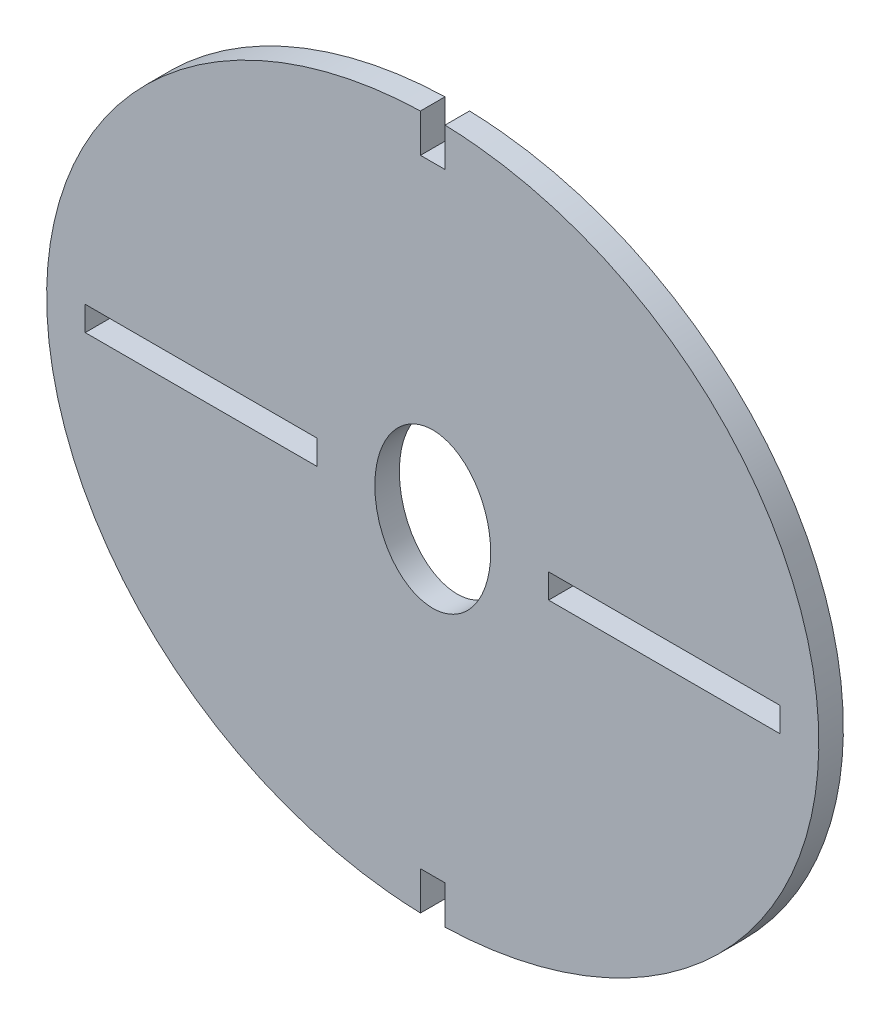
ISO-10303-21;
HEADER;
FILE_DESCRIPTION(('STEP AP214'),'2;1');
FILE_NAME('part.step','',(''),(''),'','','');
FILE_SCHEMA(('AUTOMOTIVE_DESIGN { 1 0 10303 214 1 1 1 1 }'));
ENDSEC;
DATA;
#1=APPLICATION_CONTEXT('core data for automotive mechanical design processes');
#2=APPLICATION_PROTOCOL_DEFINITION('international standard','automotive_design',2000,#1);
#3=PRODUCT_CONTEXT('',#1,'mechanical');
#4=PRODUCT('Part','Part','',(#3));
#5=PRODUCT_RELATED_PRODUCT_CATEGORY('part','',(#4));
#6=PRODUCT_DEFINITION_FORMATION('','',#4);
#7=PRODUCT_DEFINITION_CONTEXT('part definition',#1,'design');
#8=PRODUCT_DEFINITION('design','',#6,#7);
#9=PRODUCT_DEFINITION_SHAPE('','',#8);
#10=(LENGTH_UNIT() NAMED_UNIT(*) SI_UNIT(.MILLI.,.METRE.));
#11=(NAMED_UNIT(*) PLANE_ANGLE_UNIT() SI_UNIT($,.RADIAN.));
#12=(NAMED_UNIT(*) SI_UNIT($,.STERADIAN.) SOLID_ANGLE_UNIT());
#13=UNCERTAINTY_MEASURE_WITH_UNIT(LENGTH_MEASURE(1.E-05),#10,'distance_accuracy_value','');
#14=(GEOMETRIC_REPRESENTATION_CONTEXT(3) GLOBAL_UNCERTAINTY_ASSIGNED_CONTEXT((#13)) GLOBAL_UNIT_ASSIGNED_CONTEXT((#10,
#11,#12)) REPRESENTATION_CONTEXT('',''));
#15=CARTESIAN_POINT('',(0.,0.,0.));
#16=DIRECTION('',(0.,0.,1.));
#17=DIRECTION('',(1.,0.,0.));
#18=AXIS2_PLACEMENT_3D('',#15,#16,#17);
#19=CARTESIAN_POINT('',(0.,0.,3.175));
#20=DIRECTION('',(0.,0.,1.));
#21=DIRECTION('',(-1.,0.,0.));
#22=AXIS2_PLACEMENT_3D('',#19,#20,#21);
#23=ELLIPSE('',#22,50.,45.);
#24=DIRECTION('',(0.,0.,-1.));
#25=VECTOR('',#24,1.);
#26=SURFACE_OF_LINEAR_EXTRUSION('',#23,#25);
#27=CARTESIAN_POINT('',(0.,0.,0.));
#28=DIRECTION('',(0.,0.,1.));
#29=DIRECTION('',(-1.,0.,0.));
#30=AXIS2_PLACEMENT_3D('',#27,#28,#29);
#31=ELLIPSE('',#30,50.,45.);
#32=CARTESIAN_POINT('',(-1.58750000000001,44.9773128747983,0.));
#33=VERTEX_POINT('',#32);
#34=CARTESIAN_POINT('',(-1.58749999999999,-44.9773128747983,0.));
#35=VERTEX_POINT('',#34);
#36=EDGE_CURVE('E285',#33,#35,#31,.T.);
#37=ORIENTED_EDGE('',*,*,#36,.T.);
#38=DIRECTION('',(0.,0.,-1.));
#39=VECTOR('',#38,1.);
#40=CARTESIAN_POINT('',(-1.58749999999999,-44.9773128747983,3.175));
#41=LINE('',#40,#39);
#42=CARTESIAN_POINT('',(-1.58749999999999,-44.9773128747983,3.175));
#43=VERTEX_POINT('',#42);
#44=EDGE_CURVE('E41',#35,#43,#41,.F.);
#45=ORIENTED_EDGE('',*,*,#44,.T.);
#46=CARTESIAN_POINT('',(-1.5875,44.9773128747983,3.175));
#47=VERTEX_POINT('',#46);
#48=EDGE_CURVE('E289',#47,#43,#23,.T.);
#49=ORIENTED_EDGE('',*,*,#48,.F.);
#50=DIRECTION('',(0.,0.,-1.));
#51=VECTOR('',#50,1.);
#52=CARTESIAN_POINT('',(-1.5875,44.9773128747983,3.175));
#53=LINE('',#52,#51);
#54=EDGE_CURVE('E287',#47,#33,#53,.T.);
#55=ORIENTED_EDGE('',*,*,#54,.T.);
#56=EDGE_LOOP('',(#37,#45,#49,#55));
#57=FACE_BOUND('',#56,.T.);
#58=ADVANCED_FACE('F32',(#57),#26,.F.);
#59=CARTESIAN_POINT('',(0.,0.,3.175));
#60=DIRECTION('',(0.,0.,1.));
#61=DIRECTION('',(1.,0.,0.));
#62=AXIS2_PLACEMENT_3D('',#59,#60,#61);
#63=PLANE('',#62);
#64=DIRECTION('',(0.,-1.,0.));
#65=VECTOR('',#64,1.);
#66=CARTESIAN_POINT('',(-1.58749999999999,-40.,3.175));
#67=LINE('',#66,#65);
#68=CARTESIAN_POINT('',(-1.58749999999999,-40.,3.175));
#69=VERTEX_POINT('',#68);
#70=EDGE_CURVE('E160',#69,#43,#67,.T.);
#71=ORIENTED_EDGE('',*,*,#70,.F.);
#72=DIRECTION('',(-1.,0.,0.));
#73=VECTOR('',#72,1.);
#74=CARTESIAN_POINT('',(0.,-40.,3.175));
#75=LINE('',#74,#73);
#76=CARTESIAN_POINT('',(1.58750000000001,-40.,3.175));
#77=VERTEX_POINT('',#76);
#78=EDGE_CURVE('E153',#77,#69,#75,.T.);
#79=ORIENTED_EDGE('',*,*,#78,.F.);
#80=DIRECTION('',(0.,1.,0.));
#81=VECTOR('',#80,1.);
#82=CARTESIAN_POINT('',(1.58750000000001,-56.8634224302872,3.175));
#83=LINE('',#82,#81);
#84=CARTESIAN_POINT('',(1.58750000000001,-44.9773128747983,3.175));
#85=VERTEX_POINT('',#84);
#86=EDGE_CURVE('E157',#85,#77,#83,.T.);
#87=ORIENTED_EDGE('',*,*,#86,.F.);
#88=CARTESIAN_POINT('',(1.58750000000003,44.9773128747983,3.175));
#89=VERTEX_POINT('',#88);
#90=EDGE_CURVE('E56',#85,#89,#23,.T.);
#91=ORIENTED_EDGE('',*,*,#90,.T.);
#92=DIRECTION('',(0.,1.,0.));
#93=VECTOR('',#92,1.);
#94=CARTESIAN_POINT('',(1.5875,56.8634224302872,3.175));
#95=LINE('',#94,#93);
#96=CARTESIAN_POINT('',(1.5875,40.,3.175));
#97=VERTEX_POINT('',#96);
#98=EDGE_CURVE('E173',#97,#89,#95,.T.);
#99=ORIENTED_EDGE('',*,*,#98,.F.);
#100=DIRECTION('',(1.,0.,0.));
#101=VECTOR('',#100,1.);
#102=CARTESIAN_POINT('',(0.,40.,3.175));
#103=LINE('',#102,#101);
#104=CARTESIAN_POINT('',(-1.5875,40.,3.175));
#105=VERTEX_POINT('',#104);
#106=EDGE_CURVE('E178',#105,#97,#103,.T.);
#107=ORIENTED_EDGE('',*,*,#106,.F.);
#108=DIRECTION('',(0.,-1.,0.));
#109=VECTOR('',#108,1.);
#110=CARTESIAN_POINT('',(-1.5875,40.,3.175));
#111=LINE('',#110,#109);
#112=EDGE_CURVE('E175',#47,#105,#111,.T.);
#113=ORIENTED_EDGE('',*,*,#112,.F.);
#114=ORIENTED_EDGE('',*,*,#48,.T.);
#115=EDGE_LOOP('',(#71,#79,#87,#91,#99,#107,#113,#114));
#116=FACE_BOUND('',#115,.T.);
#117=CARTESIAN_POINT('',(0.,0.,3.175));
#118=DIRECTION('',(0.,0.,1.));
#119=DIRECTION('',(0.,-1.,0.));
#120=AXIS2_PLACEMENT_3D('',#117,#118,#119);
#121=ELLIPSE('',#120,10.,7.5);
#122=CARTESIAN_POINT('',(0.,-10.,3.175));
#123=VERTEX_POINT('',#122);
#124=EDGE_CURVE('E254',#123,#123,#121,.T.);
#125=ORIENTED_EDGE('',*,*,#124,.F.);
#126=EDGE_LOOP('',(#125));
#127=FACE_BOUND('',#126,.T.);
#128=DIRECTION('',(1.,0.,0.));
#129=VECTOR('',#128,1.);
#130=CARTESIAN_POINT('',(-45.,-1.58750000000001,3.175));
#131=LINE('',#130,#129);
#132=CARTESIAN_POINT('',(-45.,-1.58750000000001,3.175));
#133=VERTEX_POINT('',#132);
#134=CARTESIAN_POINT('',(-15.,-1.58750000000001,3.175));
#135=VERTEX_POINT('',#134);
#136=EDGE_CURVE('E225',#133,#135,#131,.T.);
#137=ORIENTED_EDGE('',*,*,#136,.F.);
#138=DIRECTION('',(0.,-1.,0.));
#139=VECTOR('',#138,1.);
#140=CARTESIAN_POINT('',(-45.,1.58749999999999,3.175));
#141=LINE('',#140,#139);
#142=CARTESIAN_POINT('',(-45.,1.58749999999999,3.175));
#143=VERTEX_POINT('',#142);
#144=EDGE_CURVE('E223',#143,#133,#141,.T.);
#145=ORIENTED_EDGE('',*,*,#144,.F.);
#146=DIRECTION('',(-1.,0.,0.));
#147=VECTOR('',#146,1.);
#148=CARTESIAN_POINT('',(-15.,1.5875,3.175));
#149=LINE('',#148,#147);
#150=CARTESIAN_POINT('',(-15.,1.5875,3.175));
#151=VERTEX_POINT('',#150);
#152=EDGE_CURVE('E231',#151,#143,#149,.T.);
#153=ORIENTED_EDGE('',*,*,#152,.F.);
#154=DIRECTION('',(0.,1.,0.));
#155=VECTOR('',#154,1.);
#156=CARTESIAN_POINT('',(-15.,1.5875,3.175));
#157=LINE('',#156,#155);
#158=EDGE_CURVE('E228',#135,#151,#157,.T.);
#159=ORIENTED_EDGE('',*,*,#158,.F.);
#160=EDGE_LOOP('',(#137,#145,#153,#159));
#161=FACE_BOUND('',#160,.T.);
#162=DIRECTION('',(0.,-1.,0.));
#163=VECTOR('',#162,1.);
#164=CARTESIAN_POINT('',(15.,1.5875,3.175));
#165=LINE('',#164,#163);
#166=CARTESIAN_POINT('',(15.,1.5875,3.175));
#167=VERTEX_POINT('',#166);
#168=CARTESIAN_POINT('',(15.,-1.5875,3.175));
#169=VERTEX_POINT('',#168);
#170=EDGE_CURVE('E194',#167,#169,#165,.T.);
#171=ORIENTED_EDGE('',*,*,#170,.F.);
#172=DIRECTION('',(-1.,0.,0.));
#173=VECTOR('',#172,1.);
#174=CARTESIAN_POINT('',(15.,1.5875,3.175));
#175=LINE('',#174,#173);
#176=CARTESIAN_POINT('',(45.,1.58750000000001,3.175));
#177=VERTEX_POINT('',#176);
#178=EDGE_CURVE('E192',#177,#167,#175,.T.);
#179=ORIENTED_EDGE('',*,*,#178,.F.);
#180=DIRECTION('',(0.,1.,0.));
#181=VECTOR('',#180,1.);
#182=CARTESIAN_POINT('',(45.,1.58750000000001,3.175));
#183=LINE('',#182,#181);
#184=CARTESIAN_POINT('',(45.,-1.58749999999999,3.175));
#185=VERTEX_POINT('',#184);
#186=EDGE_CURVE('E200',#185,#177,#183,.T.);
#187=ORIENTED_EDGE('',*,*,#186,.F.);
#188=DIRECTION('',(1.,0.,0.));
#189=VECTOR('',#188,1.);
#190=CARTESIAN_POINT('',(45.,-1.58749999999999,3.175));
#191=LINE('',#190,#189);
#192=EDGE_CURVE('E197',#169,#185,#191,.T.);
#193=ORIENTED_EDGE('',*,*,#192,.F.);
#194=EDGE_LOOP('',(#171,#179,#187,#193));
#195=FACE_BOUND('',#194,.T.);
#196=ADVANCED_FACE('F162',(#116,#127,#161,#195),#63,.T.);
#197=CARTESIAN_POINT('',(0.,0.,0.));
#198=DIRECTION('',(0.,0.,1.));
#199=DIRECTION('',(1.,0.,0.));
#200=AXIS2_PLACEMENT_3D('',#197,#198,#199);
#201=PLANE('',#200);
#202=DIRECTION('',(0.,-1.,0.));
#203=VECTOR('',#202,1.);
#204=CARTESIAN_POINT('',(-45.,1.58749999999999,0.));
#205=LINE('',#204,#203);
#206=CARTESIAN_POINT('',(-45.,1.58749999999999,0.));
#207=VERTEX_POINT('',#206);
#208=CARTESIAN_POINT('',(-45.,-1.58750000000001,0.));
#209=VERTEX_POINT('',#208);
#210=EDGE_CURVE('E222',#207,#209,#205,.T.);
#211=ORIENTED_EDGE('',*,*,#210,.T.);
#212=DIRECTION('',(1.,0.,0.));
#213=VECTOR('',#212,1.);
#214=CARTESIAN_POINT('',(-45.,-1.58750000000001,0.));
#215=LINE('',#214,#213);
#216=CARTESIAN_POINT('',(-15.,-1.58750000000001,0.));
#217=VERTEX_POINT('',#216);
#218=EDGE_CURVE('E236',#209,#217,#215,.T.);
#219=ORIENTED_EDGE('',*,*,#218,.T.);
#220=DIRECTION('',(0.,1.,0.));
#221=VECTOR('',#220,1.);
#222=CARTESIAN_POINT('',(-15.,1.5875,0.));
#223=LINE('',#222,#221);
#224=CARTESIAN_POINT('',(-15.,1.5875,0.));
#225=VERTEX_POINT('',#224);
#226=EDGE_CURVE('E239',#217,#225,#223,.T.);
#227=ORIENTED_EDGE('',*,*,#226,.T.);
#228=DIRECTION('',(-1.,0.,0.));
#229=VECTOR('',#228,1.);
#230=CARTESIAN_POINT('',(-15.,1.5875,0.));
#231=LINE('',#230,#229);
#232=EDGE_CURVE('E226',#225,#207,#231,.T.);
#233=ORIENTED_EDGE('',*,*,#232,.T.);
#234=EDGE_LOOP('',(#211,#219,#227,#233));
#235=FACE_BOUND('',#234,.T.);
#236=DIRECTION('',(-1.,0.,0.));
#237=VECTOR('',#236,1.);
#238=CARTESIAN_POINT('',(0.,-40.,0.));
#239=LINE('',#238,#237);
#240=CARTESIAN_POINT('',(1.58750000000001,-40.,0.));
#241=VERTEX_POINT('',#240);
#242=CARTESIAN_POINT('',(-1.58749999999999,-40.,0.));
#243=VERTEX_POINT('',#242);
#244=EDGE_CURVE('E11',#241,#243,#239,.T.);
#245=ORIENTED_EDGE('',*,*,#244,.T.);
#246=DIRECTION('',(0.,-1.,0.));
#247=VECTOR('',#246,1.);
#248=CARTESIAN_POINT('',(-1.5875,0.,0.));
#249=LINE('',#248,#247);
#250=EDGE_CURVE('E170',#243,#35,#249,.T.);
#251=ORIENTED_EDGE('',*,*,#250,.T.);
#252=ORIENTED_EDGE('',*,*,#36,.F.);
#253=DIRECTION('',(0.,-1.,0.));
#254=VECTOR('',#253,1.);
#255=CARTESIAN_POINT('',(-1.5875,0.,0.));
#256=LINE('',#255,#254);
#257=CARTESIAN_POINT('',(-1.5875,40.,0.));
#258=VERTEX_POINT('',#257);
#259=EDGE_CURVE('E188',#33,#258,#256,.T.);
#260=ORIENTED_EDGE('',*,*,#259,.T.);
#261=DIRECTION('',(1.,0.,0.));
#262=VECTOR('',#261,1.);
#263=CARTESIAN_POINT('',(0.,40.,0.));
#264=LINE('',#263,#262);
#265=CARTESIAN_POINT('',(1.5875,40.,0.));
#266=VERTEX_POINT('',#265);
#267=EDGE_CURVE('E296',#258,#266,#264,.T.);
#268=ORIENTED_EDGE('',*,*,#267,.T.);
#269=DIRECTION('',(0.,1.,0.));
#270=VECTOR('',#269,1.);
#271=CARTESIAN_POINT('',(1.58750000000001,0.,0.));
#272=LINE('',#271,#270);
#273=CARTESIAN_POINT('',(1.58750000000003,44.9773128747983,0.));
#274=VERTEX_POINT('',#273);
#275=EDGE_CURVE('E184',#266,#274,#272,.T.);
#276=ORIENTED_EDGE('',*,*,#275,.T.);
#277=CARTESIAN_POINT('',(1.58750000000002,-44.9773128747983,0.));
#278=VERTEX_POINT('',#277);
#279=EDGE_CURVE('E258',#278,#274,#31,.T.);
#280=ORIENTED_EDGE('',*,*,#279,.F.);
#281=DIRECTION('',(0.,1.,0.));
#282=VECTOR('',#281,1.);
#283=CARTESIAN_POINT('',(1.58750000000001,0.,0.));
#284=LINE('',#283,#282);
#285=EDGE_CURVE('E48',#278,#241,#284,.T.);
#286=ORIENTED_EDGE('',*,*,#285,.T.);
#287=EDGE_LOOP('',(#245,#251,#252,#260,#268,#276,#280,#286));
#288=FACE_BOUND('',#287,.T.);
#289=CARTESIAN_POINT('',(0.,0.,0.));
#290=DIRECTION('',(0.,0.,1.));
#291=DIRECTION('',(0.,-1.,0.));
#292=AXIS2_PLACEMENT_3D('',#289,#290,#291);
#293=ELLIPSE('',#292,10.,7.5);
#294=CARTESIAN_POINT('',(0.,-10.,0.));
#295=VERTEX_POINT('',#294);
#296=EDGE_CURVE('E253',#295,#295,#293,.T.);
#297=ORIENTED_EDGE('',*,*,#296,.T.);
#298=EDGE_LOOP('',(#297));
#299=FACE_BOUND('',#298,.T.);
#300=DIRECTION('',(-1.,0.,0.));
#301=VECTOR('',#300,1.);
#302=CARTESIAN_POINT('',(15.,1.5875,0.));
#303=LINE('',#302,#301);
#304=CARTESIAN_POINT('',(45.,1.58750000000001,0.));
#305=VERTEX_POINT('',#304);
#306=CARTESIAN_POINT('',(15.,1.5875,0.));
#307=VERTEX_POINT('',#306);
#308=EDGE_CURVE('E191',#305,#307,#303,.T.);
#309=ORIENTED_EDGE('',*,*,#308,.T.);
#310=DIRECTION('',(0.,-1.,0.));
#311=VECTOR('',#310,1.);
#312=CARTESIAN_POINT('',(15.,1.5875,0.));
#313=LINE('',#312,#311);
#314=CARTESIAN_POINT('',(15.,-1.5875,0.));
#315=VERTEX_POINT('',#314);
#316=EDGE_CURVE('E205',#307,#315,#313,.T.);
#317=ORIENTED_EDGE('',*,*,#316,.T.);
#318=DIRECTION('',(1.,0.,0.));
#319=VECTOR('',#318,1.);
#320=CARTESIAN_POINT('',(45.,-1.58749999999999,0.));
#321=LINE('',#320,#319);
#322=CARTESIAN_POINT('',(45.,-1.58749999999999,0.));
#323=VERTEX_POINT('',#322);
#324=EDGE_CURVE('E208',#315,#323,#321,.T.);
#325=ORIENTED_EDGE('',*,*,#324,.T.);
#326=DIRECTION('',(0.,1.,0.));
#327=VECTOR('',#326,1.);
#328=CARTESIAN_POINT('',(45.,1.58750000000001,0.));
#329=LINE('',#328,#327);
#330=EDGE_CURVE('E195',#323,#305,#329,.T.);
#331=ORIENTED_EDGE('',*,*,#330,.T.);
#332=EDGE_LOOP('',(#309,#317,#325,#331));
#333=FACE_BOUND('',#332,.T.);
#334=ADVANCED_FACE('F268',(#235,#288,#299,#333),#201,.F.);
#335=ORIENTED_EDGE('',*,*,#90,.F.);
#336=DIRECTION('',(0.,0.,-1.));
#337=VECTOR('',#336,1.);
#338=CARTESIAN_POINT('',(1.58750000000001,-44.9773128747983,3.175));
#339=LINE('',#338,#337);
#340=EDGE_CURVE('E159',#85,#278,#339,.T.);
#341=ORIENTED_EDGE('',*,*,#340,.T.);
#342=ORIENTED_EDGE('',*,*,#279,.T.);
#343=DIRECTION('',(0.,0.,-1.));
#344=VECTOR('',#343,1.);
#345=CARTESIAN_POINT('',(1.5875,44.9773128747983,3.175));
#346=LINE('',#345,#344);
#347=EDGE_CURVE('E292',#274,#89,#346,.F.);
#348=ORIENTED_EDGE('',*,*,#347,.T.);
#349=EDGE_LOOP('',(#335,#341,#342,#348));
#350=FACE_BOUND('',#349,.T.);
#351=ADVANCED_FACE('F34',(#350),#26,.F.);
#352=DIRECTION('',(0.,0.,-1.));
#353=VECTOR('',#352,1.);
#354=SURFACE_OF_LINEAR_EXTRUSION('',#121,#353);
#355=ORIENTED_EDGE('',*,*,#124,.T.);
#356=EDGE_LOOP('',(#355));
#357=FACE_BOUND('',#356,.T.);
#358=ORIENTED_EDGE('',*,*,#296,.F.);
#359=EDGE_LOOP('',(#358));
#360=FACE_BOUND('',#359,.T.);
#361=ADVANCED_FACE('F260',(#357,#360),#354,.T.);
#362=CARTESIAN_POINT('',(-45.,1.58749999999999,3.175));
#363=DIRECTION('',(1.,0.,0.));
#364=DIRECTION('',(0.,0.,-1.));
#365=AXIS2_PLACEMENT_3D('',#362,#363,#364);
#366=PLANE('',#365);
#367=ORIENTED_EDGE('',*,*,#210,.F.);
#368=DIRECTION('',(0.,0.,-1.));
#369=VECTOR('',#368,1.);
#370=CARTESIAN_POINT('',(-45.,1.58749999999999,3.175));
#371=LINE('',#370,#369);
#372=EDGE_CURVE('E233',#143,#207,#371,.T.);
#373=ORIENTED_EDGE('',*,*,#372,.F.);
#374=ORIENTED_EDGE('',*,*,#144,.T.);
#375=DIRECTION('',(0.,0.,-1.));
#376=VECTOR('',#375,1.);
#377=CARTESIAN_POINT('',(-45.,-1.58750000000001,3.175));
#378=LINE('',#377,#376);
#379=EDGE_CURVE('E250',#133,#209,#378,.T.);
#380=ORIENTED_EDGE('',*,*,#379,.T.);
#381=EDGE_LOOP('',(#367,#373,#374,#380));
#382=FACE_BOUND('',#381,.T.);
#383=ADVANCED_FACE('F264',(#382),#366,.T.);
#384=CARTESIAN_POINT('',(-45.,-1.58750000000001,3.175));
#385=DIRECTION('',(0.,1.,0.));
#386=DIRECTION('',(0.,0.,1.));
#387=AXIS2_PLACEMENT_3D('',#384,#385,#386);
#388=PLANE('',#387);
#389=ORIENTED_EDGE('',*,*,#218,.F.);
#390=ORIENTED_EDGE('',*,*,#379,.F.);
#391=ORIENTED_EDGE('',*,*,#136,.T.);
#392=DIRECTION('',(0.,0.,-1.));
#393=VECTOR('',#392,1.);
#394=CARTESIAN_POINT('',(-15.,-1.58750000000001,3.175));
#395=LINE('',#394,#393);
#396=EDGE_CURVE('E248',#135,#217,#395,.T.);
#397=ORIENTED_EDGE('',*,*,#396,.T.);
#398=EDGE_LOOP('',(#389,#390,#391,#397));
#399=FACE_BOUND('',#398,.T.);
#400=ADVANCED_FACE('F344',(#399),#388,.T.);
#401=CARTESIAN_POINT('',(-15.,1.5875,3.175));
#402=DIRECTION('',(-1.,0.,0.));
#403=DIRECTION('',(0.,0.,1.));
#404=AXIS2_PLACEMENT_3D('',#401,#402,#403);
#405=PLANE('',#404);
#406=ORIENTED_EDGE('',*,*,#226,.F.);
#407=ORIENTED_EDGE('',*,*,#396,.F.);
#408=ORIENTED_EDGE('',*,*,#158,.T.);
#409=DIRECTION('',(0.,0.,-1.));
#410=VECTOR('',#409,1.);
#411=CARTESIAN_POINT('',(-15.,1.5875,3.175));
#412=LINE('',#411,#410);
#413=EDGE_CURVE('E246',#151,#225,#412,.T.);
#414=ORIENTED_EDGE('',*,*,#413,.T.);
#415=EDGE_LOOP('',(#406,#407,#408,#414));
#416=FACE_BOUND('',#415,.T.);
#417=ADVANCED_FACE('F341',(#416),#405,.T.);
#418=CARTESIAN_POINT('',(-15.,1.5875,3.175));
#419=DIRECTION('',(0.,-1.,0.));
#420=DIRECTION('',(1.,0.,0.));
#421=AXIS2_PLACEMENT_3D('',#418,#419,#420);
#422=PLANE('',#421);
#423=ORIENTED_EDGE('',*,*,#232,.F.);
#424=ORIENTED_EDGE('',*,*,#413,.F.);
#425=ORIENTED_EDGE('',*,*,#152,.T.);
#426=ORIENTED_EDGE('',*,*,#372,.T.);
#427=EDGE_LOOP('',(#423,#424,#425,#426));
#428=FACE_BOUND('',#427,.T.);
#429=ADVANCED_FACE('F337',(#428),#422,.T.);
#430=CARTESIAN_POINT('',(15.,1.5875,3.175));
#431=DIRECTION('',(0.,-1.,0.));
#432=DIRECTION('',(1.,0.,0.));
#433=AXIS2_PLACEMENT_3D('',#430,#431,#432);
#434=PLANE('',#433);
#435=ORIENTED_EDGE('',*,*,#308,.F.);
#436=DIRECTION('',(0.,0.,-1.));
#437=VECTOR('',#436,1.);
#438=CARTESIAN_POINT('',(45.,1.58750000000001,3.175));
#439=LINE('',#438,#437);
#440=EDGE_CURVE('E202',#177,#305,#439,.T.);
#441=ORIENTED_EDGE('',*,*,#440,.F.);
#442=ORIENTED_EDGE('',*,*,#178,.T.);
#443=DIRECTION('',(0.,0.,-1.));
#444=VECTOR('',#443,1.);
#445=CARTESIAN_POINT('',(15.,1.5875,3.175));
#446=LINE('',#445,#444);
#447=EDGE_CURVE('E219',#167,#307,#446,.T.);
#448=ORIENTED_EDGE('',*,*,#447,.T.);
#449=EDGE_LOOP('',(#435,#441,#442,#448));
#450=FACE_BOUND('',#449,.T.);
#451=ADVANCED_FACE('F333',(#450),#434,.T.);
#452=CARTESIAN_POINT('',(15.,1.5875,3.175));
#453=DIRECTION('',(1.,0.,0.));
#454=DIRECTION('',(0.,0.,-1.));
#455=AXIS2_PLACEMENT_3D('',#452,#453,#454);
#456=PLANE('',#455);
#457=ORIENTED_EDGE('',*,*,#316,.F.);
#458=ORIENTED_EDGE('',*,*,#447,.F.);
#459=ORIENTED_EDGE('',*,*,#170,.T.);
#460=DIRECTION('',(0.,0.,-1.));
#461=VECTOR('',#460,1.);
#462=CARTESIAN_POINT('',(15.,-1.5875,3.175));
#463=LINE('',#462,#461);
#464=EDGE_CURVE('E217',#169,#315,#463,.T.);
#465=ORIENTED_EDGE('',*,*,#464,.T.);
#466=EDGE_LOOP('',(#457,#458,#459,#465));
#467=FACE_BOUND('',#466,.T.);
#468=ADVANCED_FACE('F329',(#467),#456,.T.);
#469=CARTESIAN_POINT('',(45.,-1.58749999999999,3.175));
#470=DIRECTION('',(0.,1.,0.));
#471=DIRECTION('',(-1.,0.,0.));
#472=AXIS2_PLACEMENT_3D('',#469,#470,#471);
#473=PLANE('',#472);
#474=ORIENTED_EDGE('',*,*,#324,.F.);
#475=ORIENTED_EDGE('',*,*,#464,.F.);
#476=ORIENTED_EDGE('',*,*,#192,.T.);
#477=DIRECTION('',(0.,0.,-1.));
#478=VECTOR('',#477,1.);
#479=CARTESIAN_POINT('',(45.,-1.58749999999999,3.175));
#480=LINE('',#479,#478);
#481=EDGE_CURVE('E215',#185,#323,#480,.T.);
#482=ORIENTED_EDGE('',*,*,#481,.T.);
#483=EDGE_LOOP('',(#474,#475,#476,#482));
#484=FACE_BOUND('',#483,.T.);
#485=ADVANCED_FACE('F325',(#484),#473,.T.);
#486=CARTESIAN_POINT('',(45.,1.58750000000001,3.175));
#487=DIRECTION('',(-1.,0.,0.));
#488=DIRECTION('',(0.,0.,1.));
#489=AXIS2_PLACEMENT_3D('',#486,#487,#488);
#490=PLANE('',#489);
#491=ORIENTED_EDGE('',*,*,#330,.F.);
#492=ORIENTED_EDGE('',*,*,#481,.F.);
#493=ORIENTED_EDGE('',*,*,#186,.T.);
#494=ORIENTED_EDGE('',*,*,#440,.T.);
#495=EDGE_LOOP('',(#491,#492,#493,#494));
#496=FACE_BOUND('',#495,.T.);
#497=ADVANCED_FACE('F319',(#496),#490,.T.);
#498=CARTESIAN_POINT('',(0.,40.,-6.825));
#499=DIRECTION('',(0.,-1.,0.));
#500=DIRECTION('',(0.,0.,-1.));
#501=AXIS2_PLACEMENT_3D('',#498,#499,#500);
#502=PLANE('',#501);
#503=DIRECTION('',(0.,0.,1.));
#504=VECTOR('',#503,1.);
#505=CARTESIAN_POINT('',(-1.5875,40.,-6.825));
#506=LINE('',#505,#504);
#507=EDGE_CURVE('E182',#258,#105,#506,.T.);
#508=ORIENTED_EDGE('',*,*,#507,.T.);
#509=ORIENTED_EDGE('',*,*,#106,.T.);
#510=DIRECTION('',(0.,0.,1.));
#511=VECTOR('',#510,1.);
#512=CARTESIAN_POINT('',(1.5875,40.,-6.825));
#513=LINE('',#512,#511);
#514=EDGE_CURVE('E181',#266,#97,#513,.T.);
#515=ORIENTED_EDGE('',*,*,#514,.F.);
#516=ORIENTED_EDGE('',*,*,#267,.F.);
#517=EDGE_LOOP('',(#508,#509,#515,#516));
#518=FACE_BOUND('',#517,.T.);
#519=ADVANCED_FACE('F306',(#518),#502,.F.);
#520=CARTESIAN_POINT('',(-1.5875,40.,-6.825));
#521=DIRECTION('',(-1.,0.,0.));
#522=DIRECTION('',(0.,0.,1.));
#523=AXIS2_PLACEMENT_3D('',#520,#521,#522);
#524=PLANE('',#523);
#525=ORIENTED_EDGE('',*,*,#54,.F.);
#526=ORIENTED_EDGE('',*,*,#112,.T.);
#527=ORIENTED_EDGE('',*,*,#507,.F.);
#528=ORIENTED_EDGE('',*,*,#259,.F.);
#529=EDGE_LOOP('',(#525,#526,#527,#528));
#530=FACE_BOUND('',#529,.T.);
#531=ADVANCED_FACE('F311',(#530),#524,.F.);
#532=CARTESIAN_POINT('',(1.5875,56.8634224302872,-6.825));
#533=DIRECTION('',(1.,0.,0.));
#534=DIRECTION('',(0.,1.,0.));
#535=AXIS2_PLACEMENT_3D('',#532,#533,#534);
#536=PLANE('',#535);
#537=ORIENTED_EDGE('',*,*,#514,.T.);
#538=ORIENTED_EDGE('',*,*,#98,.T.);
#539=ORIENTED_EDGE('',*,*,#347,.F.);
#540=ORIENTED_EDGE('',*,*,#275,.F.);
#541=EDGE_LOOP('',(#537,#538,#539,#540));
#542=FACE_BOUND('',#541,.T.);
#543=ADVANCED_FACE('F304',(#542),#536,.F.);
#544=CARTESIAN_POINT('',(0.,-40.,-6.825));
#545=DIRECTION('',(0.,1.,0.));
#546=DIRECTION('',(0.,0.,1.));
#547=AXIS2_PLACEMENT_3D('',#544,#545,#546);
#548=PLANE('',#547);
#549=DIRECTION('',(0.,0.,1.));
#550=VECTOR('',#549,1.);
#551=CARTESIAN_POINT('',(1.58750000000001,-40.,-6.825));
#552=LINE('',#551,#550);
#553=EDGE_CURVE('E148',#241,#77,#552,.T.);
#554=ORIENTED_EDGE('',*,*,#553,.T.);
#555=ORIENTED_EDGE('',*,*,#78,.T.);
#556=DIRECTION('',(0.,0.,1.));
#557=VECTOR('',#556,1.);
#558=CARTESIAN_POINT('',(-1.58749999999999,-40.,-6.825));
#559=LINE('',#558,#557);
#560=EDGE_CURVE('E155',#243,#69,#559,.T.);
#561=ORIENTED_EDGE('',*,*,#560,.F.);
#562=ORIENTED_EDGE('',*,*,#244,.F.);
#563=EDGE_LOOP('',(#554,#555,#561,#562));
#564=FACE_BOUND('',#563,.T.);
#565=ADVANCED_FACE('F150',(#564),#548,.F.);
#566=CARTESIAN_POINT('',(-1.58749999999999,-40.,-6.825));
#567=DIRECTION('',(-1.,0.,0.));
#568=DIRECTION('',(0.,-1.,0.));
#569=AXIS2_PLACEMENT_3D('',#566,#567,#568);
#570=PLANE('',#569);
#571=ORIENTED_EDGE('',*,*,#560,.T.);
#572=ORIENTED_EDGE('',*,*,#70,.T.);
#573=ORIENTED_EDGE('',*,*,#44,.F.);
#574=ORIENTED_EDGE('',*,*,#250,.F.);
#575=EDGE_LOOP('',(#571,#572,#573,#574));
#576=FACE_BOUND('',#575,.T.);
#577=ADVANCED_FACE('F421',(#576),#570,.F.);
#578=CARTESIAN_POINT('',(1.58750000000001,-56.8634224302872,-6.825));
#579=DIRECTION('',(1.,0.,0.));
#580=DIRECTION('',(0.,1.,0.));
#581=AXIS2_PLACEMENT_3D('',#578,#579,#580);
#582=PLANE('',#581);
#583=ORIENTED_EDGE('',*,*,#340,.F.);
#584=ORIENTED_EDGE('',*,*,#86,.T.);
#585=ORIENTED_EDGE('',*,*,#553,.F.);
#586=ORIENTED_EDGE('',*,*,#285,.F.);
#587=EDGE_LOOP('',(#583,#584,#585,#586));
#588=FACE_BOUND('',#587,.T.);
#589=ADVANCED_FACE('F158',(#588),#582,.F.);
#590=CLOSED_SHELL('',(#58,#196,#334,#351,#361,#383,#400,#417,#429,#451,#468,#485,#497,#519,#531,
#543,#565,#577,#589));
#591=MANIFOLD_SOLID_BREP('B2',#590);
#592=ADVANCED_BREP_SHAPE_REPRESENTATION('',(#18,#591),#14);
#593=SHAPE_DEFINITION_REPRESENTATION(#9,#592);
ENDSEC;
END-ISO-10303-21;
